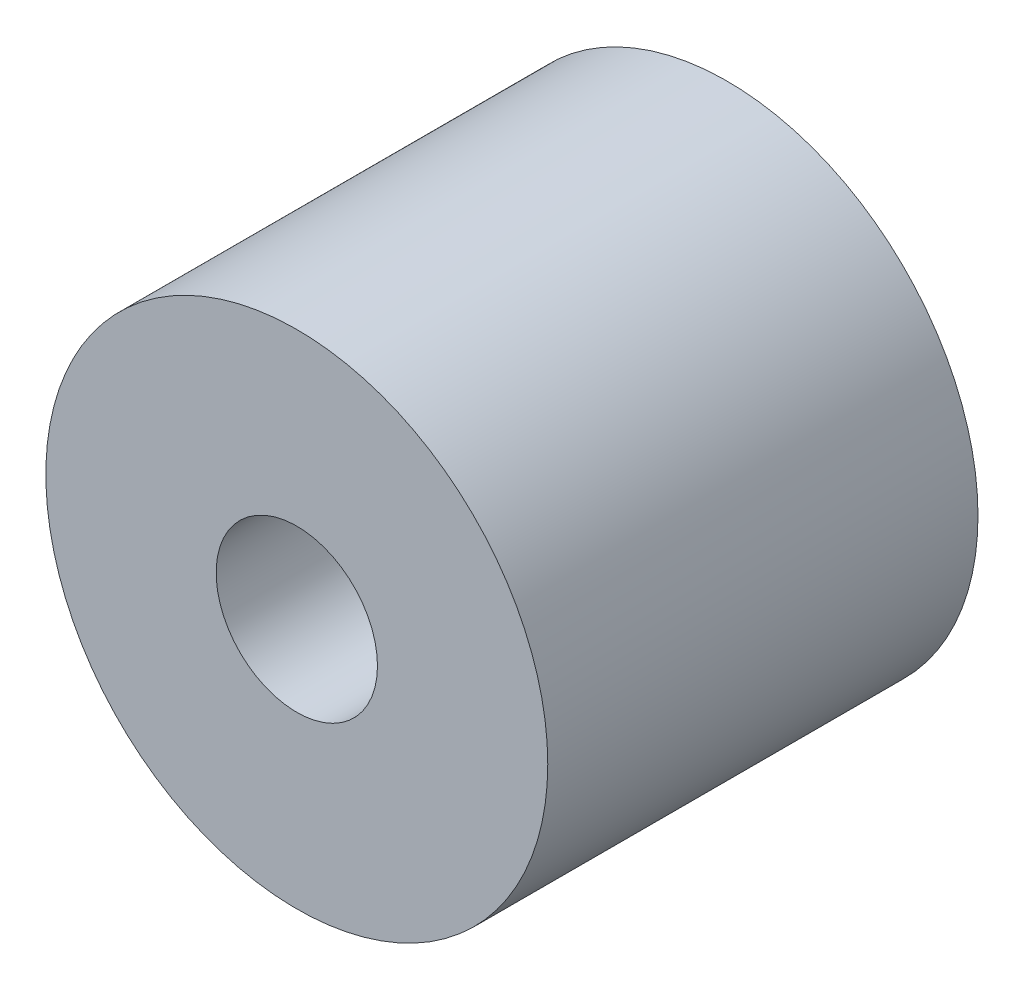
from build123d import *

# Parameters (mm, degrees)
SKETCH1_R           = 7
SKETCH1_R_2         = 2.25
BOSS_EXTRUDE1_DEPTH = 12


with BuildPart() as part:
    # Sketch1 → Boss-Extrude1 (new body)
    with BuildSketch(Plane.XY):
        Circle(SKETCH1_R)
        Circle(SKETCH1_R_2, mode=Mode.SUBTRACT)
    extrude(amount=BOSS_EXTRUDE1_DEPTH)


solid = part.part
